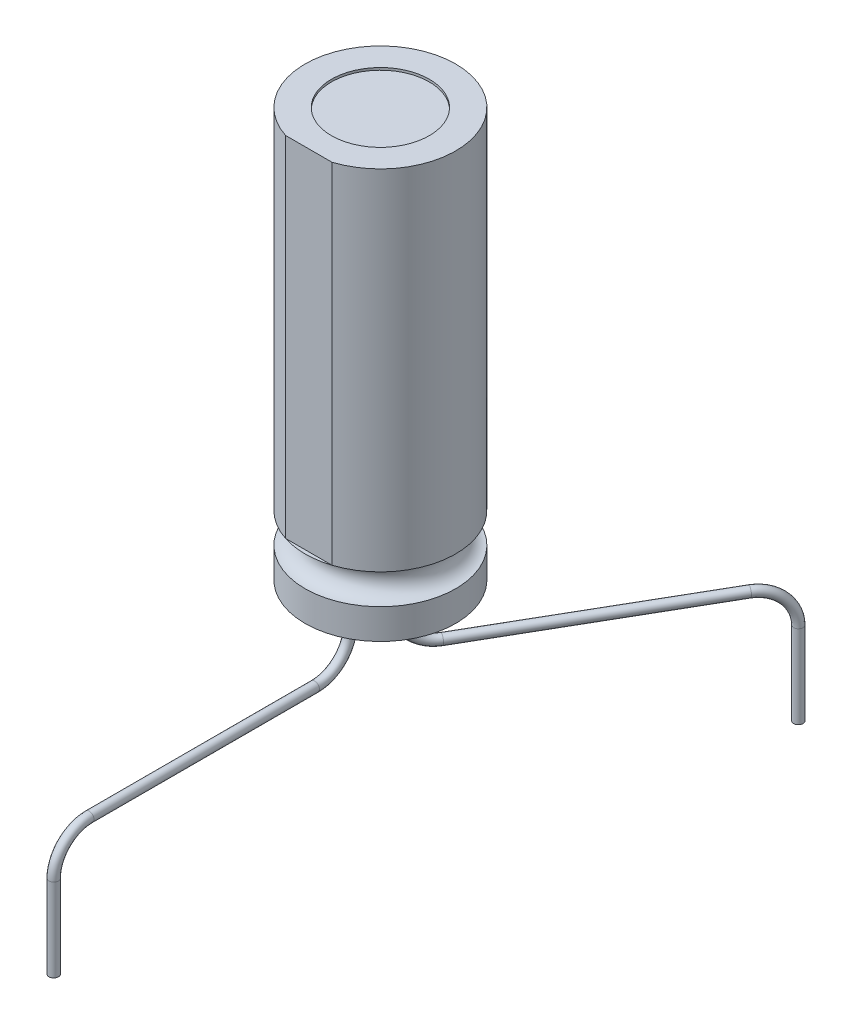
ISO-10303-21;
HEADER;
FILE_DESCRIPTION(('STEP AP214'),'2;1');
FILE_NAME('part.step','',(''),(''),'','','');
FILE_SCHEMA(('AUTOMOTIVE_DESIGN { 1 0 10303 214 1 1 1 1 }'));
ENDSEC;
DATA;
#1=APPLICATION_CONTEXT('core data for automotive mechanical design processes');
#2=APPLICATION_PROTOCOL_DEFINITION('international standard','automotive_design',2000,#1);
#3=PRODUCT_CONTEXT('',#1,'mechanical');
#4=PRODUCT('Part','Part','',(#3));
#5=PRODUCT_RELATED_PRODUCT_CATEGORY('part','',(#4));
#6=PRODUCT_DEFINITION_FORMATION('','',#4);
#7=PRODUCT_DEFINITION_CONTEXT('part definition',#1,'design');
#8=PRODUCT_DEFINITION('design','',#6,#7);
#9=PRODUCT_DEFINITION_SHAPE('','',#8);
#10=(LENGTH_UNIT() NAMED_UNIT(*) SI_UNIT(.MILLI.,.METRE.));
#11=(NAMED_UNIT(*) PLANE_ANGLE_UNIT() SI_UNIT($,.RADIAN.));
#12=(NAMED_UNIT(*) SI_UNIT($,.STERADIAN.) SOLID_ANGLE_UNIT());
#13=UNCERTAINTY_MEASURE_WITH_UNIT(LENGTH_MEASURE(1.E-05),#10,'distance_accuracy_value','');
#14=(GEOMETRIC_REPRESENTATION_CONTEXT(3) GLOBAL_UNCERTAINTY_ASSIGNED_CONTEXT((#13)) GLOBAL_UNIT_ASSIGNED_CONTEXT((#10,
#11,#12)) REPRESENTATION_CONTEXT('',''));
#15=CARTESIAN_POINT('',(0.,0.,0.));
#16=DIRECTION('',(0.,0.,1.));
#17=DIRECTION('',(1.,0.,0.));
#18=AXIS2_PLACEMENT_3D('',#15,#16,#17);
#19=CARTESIAN_POINT('',(6.35,5.01642366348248,0.));
#20=DIRECTION('',(0.,1.,0.));
#21=DIRECTION('',(0.,0.,1.));
#22=AXIS2_PLACEMENT_3D('',#19,#20,#21);
#23=PLANE('',#22);
#24=CARTESIAN_POINT('',(0.,5.01642366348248,2.54));
#25=DIRECTION('',(0.,-1.,0.));
#26=DIRECTION('',(0.,0.,-1.));
#27=AXIS2_PLACEMENT_3D('',#24,#25,#26);
#28=CIRCLE('',#27,0.4);
#29=CARTESIAN_POINT('',(0.,5.01642366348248,2.14));
#30=VERTEX_POINT('',#29);
#31=EDGE_CURVE('E34',#30,#30,#28,.T.);
#32=ORIENTED_EDGE('',*,*,#31,.F.);
#33=EDGE_LOOP('',(#32));
#34=FACE_BOUND('',#33,.T.);
#35=CARTESIAN_POINT('',(0.,5.01642366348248,0.));
#36=DIRECTION('',(0.,1.,0.));
#37=DIRECTION('',(0.,0.,1.));
#38=AXIS2_PLACEMENT_3D('',#35,#36,#37);
#39=CIRCLE('',#38,6.35);
#40=CARTESIAN_POINT('',(0.,5.01642366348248,6.35));
#41=VERTEX_POINT('',#40);
#42=EDGE_CURVE('E60',#41,#41,#39,.T.);
#43=ORIENTED_EDGE('',*,*,#42,.F.);
#44=EDGE_LOOP('',(#43));
#45=FACE_BOUND('',#44,.T.);
#46=CARTESIAN_POINT('',(0.394977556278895,5.01642366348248,-0.684121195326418));
#47=DIRECTION('',(0.,-1.,0.));
#48=DIRECTION('',(0.,0.,-1.));
#49=AXIS2_PLACEMENT_3D('',#46,#47,#48);
#50=CIRCLE('',#49,0.4);
#51=CARTESIAN_POINT('',(0.394977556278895,5.01642366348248,-1.08412119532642));
#52=VERTEX_POINT('',#51);
#53=EDGE_CURVE('E11',#52,#52,#50,.T.);
#54=ORIENTED_EDGE('',*,*,#53,.F.);
#55=EDGE_LOOP('',(#54));
#56=FACE_BOUND('',#55,.T.);
#57=ADVANCED_FACE('F26',(#34,#45,#56),#23,.F.);
#58=CARTESIAN_POINT('',(0.,48.4017094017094,0.));
#59=DIRECTION('',(0.,1.,0.));
#60=DIRECTION('',(0.,0.,1.));
#61=AXIS2_PLACEMENT_3D('',#58,#59,#60);
#62=CYLINDRICAL_SURFACE('',#61,6.35);
#63=DIRECTION('',(0.,1.,0.));
#64=VECTOR('',#63,1.);
#65=CARTESIAN_POINT('',(1.95982142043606,48.4017094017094,6.04));
#66=LINE('',#65,#64);
#67=CARTESIAN_POINT('',(1.95982142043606,10.0964236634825,6.04));
#68=VERTEX_POINT('',#67);
#69=CARTESIAN_POINT('',(1.95982142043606,39.5164236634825,6.04));
#70=VERTEX_POINT('',#69);
#71=EDGE_CURVE('E42',#68,#70,#66,.T.);
#72=ORIENTED_EDGE('',*,*,#71,.F.);
#73=CARTESIAN_POINT('',(0.,10.0964236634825,0.));
#74=DIRECTION('',(0.,1.,0.));
#75=DIRECTION('',(0.,0.,1.));
#76=AXIS2_PLACEMENT_3D('',#73,#74,#75);
#77=CIRCLE('',#76,6.35);
#78=CARTESIAN_POINT('',(-1.95982142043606,10.0964236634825,6.04));
#79=VERTEX_POINT('',#78);
#80=EDGE_CURVE('E66',#68,#79,#77,.T.);
#81=ORIENTED_EDGE('',*,*,#80,.T.);
#82=DIRECTION('',(0.,1.,0.));
#83=VECTOR('',#82,1.);
#84=CARTESIAN_POINT('',(-1.95982142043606,48.4017094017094,6.04));
#85=LINE('',#84,#83);
#86=CARTESIAN_POINT('',(-1.95982142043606,39.5164236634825,6.04));
#87=VERTEX_POINT('',#86);
#88=EDGE_CURVE('E56',#87,#79,#85,.F.);
#89=ORIENTED_EDGE('',*,*,#88,.F.);
#90=CARTESIAN_POINT('',(0.,39.5164236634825,0.));
#91=DIRECTION('',(0.,1.,0.));
#92=DIRECTION('',(0.,0.,1.));
#93=AXIS2_PLACEMENT_3D('',#90,#91,#92);
#94=CIRCLE('',#93,6.35);
#95=EDGE_CURVE('E64',#70,#87,#94,.T.);
#96=ORIENTED_EDGE('',*,*,#95,.F.);
#97=EDGE_LOOP('',(#72,#81,#89,#96));
#98=FACE_BOUND('',#97,.T.);
#99=ADVANCED_FACE('F63',(#98),#62,.T.);
#100=CARTESIAN_POINT('',(0.,39.5164236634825,0.));
#101=DIRECTION('',(0.,-1.,0.));
#102=DIRECTION('',(0.,0.,-1.));
#103=AXIS2_PLACEMENT_3D('',#100,#101,#102);
#104=PLANE('',#103);
#105=CARTESIAN_POINT('',(0.,39.5164236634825,0.));
#106=DIRECTION('',(0.,1.,0.));
#107=DIRECTION('',(0.,0.,1.));
#108=AXIS2_PLACEMENT_3D('',#105,#106,#107);
#109=CIRCLE('',#108,4.125);
#110=CARTESIAN_POINT('',(0.,39.5164236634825,4.125));
#111=VERTEX_POINT('',#110);
#112=EDGE_CURVE('E74',#111,#111,#109,.T.);
#113=ORIENTED_EDGE('',*,*,#112,.F.);
#114=EDGE_LOOP('',(#113));
#115=FACE_BOUND('',#114,.T.);
#116=DIRECTION('',(-1.,0.,0.));
#117=VECTOR('',#116,1.);
#118=CARTESIAN_POINT('',(0.,39.5164236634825,6.04));
#119=LINE('',#118,#117);
#120=EDGE_CURVE('E29',#70,#87,#119,.T.);
#121=ORIENTED_EDGE('',*,*,#120,.F.);
#122=ORIENTED_EDGE('',*,*,#95,.T.);
#123=EDGE_LOOP('',(#121,#122));
#124=FACE_BOUND('',#123,.T.);
#125=ADVANCED_FACE('F69',(#115,#124),#104,.F.);
#126=CARTESIAN_POINT('',(0.,48.4017094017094,0.));
#127=DIRECTION('',(0.,1.,0.));
#128=DIRECTION('',(0.,0.,1.));
#129=AXIS2_PLACEMENT_3D('',#126,#127,#128);
#130=CYLINDRICAL_SURFACE('',#129,6.35);
#131=CARTESIAN_POINT('',(0.,7.55642366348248,0.));
#132=DIRECTION('',(0.,1.,0.));
#133=DIRECTION('',(0.,0.,1.));
#134=AXIS2_PLACEMENT_3D('',#131,#132,#133);
#135=CIRCLE('',#134,6.35);
#136=CARTESIAN_POINT('',(0.,7.55642366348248,6.35));
#137=VERTEX_POINT('',#136);
#138=EDGE_CURVE('E78',#137,#137,#135,.T.);
#139=ORIENTED_EDGE('',*,*,#138,.F.);
#140=EDGE_LOOP('',(#139));
#141=FACE_BOUND('',#140,.T.);
#142=ORIENTED_EDGE('',*,*,#42,.T.);
#143=EDGE_LOOP('',(#142));
#144=FACE_BOUND('',#143,.T.);
#145=ADVANCED_FACE('F83',(#141,#144),#130,.T.);
#146=CARTESIAN_POINT('',(0.,8.82642366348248,0.));
#147=DIRECTION('',(0.,1.,0.));
#148=DIRECTION('',(0.,0.,1.));
#149=AXIS2_PLACEMENT_3D('',#146,#147,#148);
#150=TOROIDAL_SURFACE('',#149,6.35,1.27);
#151=ORIENTED_EDGE('',*,*,#80,.F.);
#152=EDGE_CURVE('E49',#79,#68,#77,.T.);
#153=ORIENTED_EDGE('',*,*,#152,.F.);
#154=EDGE_LOOP('',(#151,#153));
#155=FACE_BOUND('',#154,.T.);
#156=ORIENTED_EDGE('',*,*,#138,.T.);
#157=EDGE_LOOP('',(#156));
#158=FACE_BOUND('',#157,.T.);
#159=ADVANCED_FACE('F154',(#155,#158),#150,.F.);
#160=CARTESIAN_POINT('',(0.,39.3164236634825,0.));
#161=DIRECTION('',(0.,1.,0.));
#162=DIRECTION('',(0.,0.,1.));
#163=AXIS2_PLACEMENT_3D('',#160,#161,#162);
#164=CYLINDRICAL_SURFACE('',#163,4.125);
#165=CARTESIAN_POINT('',(0.,39.3164236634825,0.));
#166=DIRECTION('',(0.,1.,0.));
#167=DIRECTION('',(0.,0.,1.));
#168=AXIS2_PLACEMENT_3D('',#165,#166,#167);
#169=CIRCLE('',#168,4.125);
#170=CARTESIAN_POINT('',(0.,39.3164236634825,4.125));
#171=VERTEX_POINT('',#170);
#172=EDGE_CURVE('E70',#171,#171,#169,.T.);
#173=ORIENTED_EDGE('',*,*,#172,.F.);
#174=EDGE_LOOP('',(#173));
#175=FACE_BOUND('',#174,.T.);
#176=ORIENTED_EDGE('',*,*,#112,.T.);
#177=EDGE_LOOP('',(#176));
#178=FACE_BOUND('',#177,.T.);
#179=ADVANCED_FACE('F150',(#175,#178),#164,.F.);
#180=CARTESIAN_POINT('',(0.,39.3164236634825,0.));
#181=DIRECTION('',(0.,1.,0.));
#182=DIRECTION('',(0.,0.,1.));
#183=AXIS2_PLACEMENT_3D('',#180,#181,#182);
#184=PLANE('',#183);
#185=ORIENTED_EDGE('',*,*,#172,.T.);
#186=EDGE_LOOP('',(#185));
#187=FACE_BOUND('',#186,.T.);
#188=ADVANCED_FACE('F147',(#187),#184,.T.);
#189=CARTESIAN_POINT('',(-2.5,10.0964236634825,6.04));
#190=DIRECTION('',(0.,-1.,0.));
#191=DIRECTION('',(0.,0.,-1.));
#192=AXIS2_PLACEMENT_3D('',#189,#190,#191);
#193=PLANE('',#192);
#194=DIRECTION('',(1.,0.,0.));
#195=VECTOR('',#194,1.);
#196=CARTESIAN_POINT('',(-2.5,10.0964236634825,6.04));
#197=LINE('',#196,#195);
#198=EDGE_CURVE('E67',#79,#68,#197,.T.);
#199=ORIENTED_EDGE('',*,*,#198,.F.);
#200=ORIENTED_EDGE('',*,*,#152,.T.);
#201=EDGE_LOOP('',(#199,#200));
#202=FACE_BOUND('',#201,.T.);
#203=ADVANCED_FACE('F144',(#202),#193,.F.);
#204=CARTESIAN_POINT('',(-2.5,10.0964236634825,6.04));
#205=DIRECTION('',(0.,0.,1.));
#206=DIRECTION('',(1.,0.,0.));
#207=AXIS2_PLACEMENT_3D('',#204,#205,#206);
#208=PLANE('',#207);
#209=ORIENTED_EDGE('',*,*,#71,.T.);
#210=ORIENTED_EDGE('',*,*,#120,.T.);
#211=ORIENTED_EDGE('',*,*,#88,.T.);
#212=ORIENTED_EDGE('',*,*,#198,.T.);
#213=EDGE_LOOP('',(#209,#210,#211,#212));
#214=FACE_BOUND('',#213,.T.);
#215=ADVANCED_FACE('F55',(#214),#208,.T.);
#216=CARTESIAN_POINT('',(0.,-2.98357633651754,27.54));
#217=DIRECTION('',(0.,-1.,0.));
#218=DIRECTION('',(0.,0.,-1.));
#219=AXIS2_PLACEMENT_3D('',#216,#217,#218);
#220=CYLINDRICAL_SURFACE('',#219,0.4);
#221=CARTESIAN_POINT('',(0.,-2.98357633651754,27.54));
#222=DIRECTION('',(0.,-1.,0.));
#223=DIRECTION('',(0.,0.,-1.));
#224=AXIS2_PLACEMENT_3D('',#221,#222,#223);
#225=CIRCLE('',#224,0.4);
#226=CARTESIAN_POINT('',(0.,-2.98357633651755,27.94));
#227=VERTEX_POINT('',#226);
#228=EDGE_CURVE('E258',#227,#227,#225,.T.);
#229=ORIENTED_EDGE('',*,*,#228,.T.);
#230=EDGE_LOOP('',(#229));
#231=FACE_BOUND('',#230,.T.);
#232=CARTESIAN_POINT('',(0.,-9.98357633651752,27.54));
#233=DIRECTION('',(0.,-1.,0.));
#234=DIRECTION('',(0.,0.,-1.));
#235=AXIS2_PLACEMENT_3D('',#232,#233,#234);
#236=CIRCLE('',#235,0.4);
#237=CARTESIAN_POINT('',(0.,-9.98357633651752,27.14));
#238=VERTEX_POINT('',#237);
#239=EDGE_CURVE('E255',#238,#238,#236,.T.);
#240=ORIENTED_EDGE('',*,*,#239,.F.);
#241=EDGE_LOOP('',(#240));
#242=FACE_BOUND('',#241,.T.);
#243=ADVANCED_FACE('F137',(#231,#242),#220,.T.);
#244=CARTESIAN_POINT('',(0.,-2.98357633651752,24.54));
#245=DIRECTION('',(1.,0.,0.));
#246=DIRECTION('',(0.,0.,-1.));
#247=AXIS2_PLACEMENT_3D('',#244,#245,#246);
#248=TOROIDAL_SURFACE('',#247,3.,0.4);
#249=CARTESIAN_POINT('',(0.,0.0164236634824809,24.54));
#250=DIRECTION('',(0.,0.,1.));
#251=DIRECTION('',(0.,-1.,0.));
#252=AXIS2_PLACEMENT_3D('',#249,#250,#251);
#253=CIRCLE('',#252,0.4);
#254=CARTESIAN_POINT('',(0.,0.416423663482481,24.54));
#255=VERTEX_POINT('',#254);
#256=EDGE_CURVE('E261',#255,#255,#253,.T.);
#257=CARTESIAN_POINT('',(0.,-2.98357633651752,24.54));
#258=DIRECTION('',(1.,0.,0.));
#259=DIRECTION('',(0.,0.,-1.));
#260=AXIS2_PLACEMENT_3D('',#257,#258,#259);
#261=CIRCLE('',#260,3.4);
#262=EDGE_CURVE('',#255,#227,#261,.T.);
#263=ORIENTED_EDGE('',*,*,#256,.T.);
#264=ORIENTED_EDGE('',*,*,#228,.F.);
#265=ORIENTED_EDGE('',*,*,#262,.T.);
#266=ORIENTED_EDGE('',*,*,#262,.F.);
#267=EDGE_LOOP('',(#263,#265,#264,#266));
#268=FACE_BOUND('',#267,.T.);
#269=ADVANCED_FACE('F133',(#268),#248,.T.);
#270=CARTESIAN_POINT('',(0.,0.0164236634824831,5.54000000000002));
#271=DIRECTION('',(0.,0.,1.));
#272=DIRECTION('',(0.,-1.,0.));
#273=AXIS2_PLACEMENT_3D('',#270,#271,#272);
#274=CYLINDRICAL_SURFACE('',#273,0.4);
#275=CARTESIAN_POINT('',(0.,0.0164236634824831,5.54000000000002));
#276=DIRECTION('',(0.,0.,1.));
#277=DIRECTION('',(0.,-1.,0.));
#278=AXIS2_PLACEMENT_3D('',#275,#276,#277);
#279=CIRCLE('',#278,0.4);
#280=CARTESIAN_POINT('',(0.,-0.383576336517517,5.54000000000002));
#281=VERTEX_POINT('',#280);
#282=EDGE_CURVE('E264',#281,#281,#279,.T.);
#283=ORIENTED_EDGE('',*,*,#282,.T.);
#284=EDGE_LOOP('',(#283));
#285=FACE_BOUND('',#284,.T.);
#286=ORIENTED_EDGE('',*,*,#256,.F.);
#287=EDGE_LOOP('',(#286));
#288=FACE_BOUND('',#287,.T.);
#289=ADVANCED_FACE('F129',(#285,#288),#274,.T.);
#290=CARTESIAN_POINT('',(0.,3.01642366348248,5.54));
#291=DIRECTION('',(-1.,0.,0.));
#292=DIRECTION('',(0.,0.,1.));
#293=AXIS2_PLACEMENT_3D('',#290,#291,#292);
#294=TOROIDAL_SURFACE('',#293,3.,0.4);
#295=CARTESIAN_POINT('',(0.,3.0164236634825,2.54));
#296=DIRECTION('',(0.,-1.,0.));
#297=DIRECTION('',(0.,0.,-1.));
#298=AXIS2_PLACEMENT_3D('',#295,#296,#297);
#299=CIRCLE('',#298,0.4);
#300=CARTESIAN_POINT('',(0.,3.01642366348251,2.14));
#301=VERTEX_POINT('',#300);
#302=EDGE_CURVE('E267',#301,#301,#299,.T.);
#303=CARTESIAN_POINT('',(0.,3.01642366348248,5.54));
#304=DIRECTION('',(-1.,0.,0.));
#305=DIRECTION('',(0.,0.,1.));
#306=AXIS2_PLACEMENT_3D('',#303,#304,#305);
#307=CIRCLE('',#306,3.4);
#308=EDGE_CURVE('',#301,#281,#307,.T.);
#309=ORIENTED_EDGE('',*,*,#302,.T.);
#310=ORIENTED_EDGE('',*,*,#282,.F.);
#311=ORIENTED_EDGE('',*,*,#308,.T.);
#312=ORIENTED_EDGE('',*,*,#308,.F.);
#313=EDGE_LOOP('',(#309,#311,#310,#312));
#314=FACE_BOUND('',#313,.T.);
#315=ADVANCED_FACE('F125',(#314),#294,.T.);
#316=CARTESIAN_POINT('',(0.,3.0164236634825,2.54));
#317=DIRECTION('',(0.,1.,0.));
#318=DIRECTION('',(0.,0.,1.));
#319=AXIS2_PLACEMENT_3D('',#316,#317,#318);
#320=CYLINDRICAL_SURFACE('',#319,0.4);
#321=ORIENTED_EDGE('',*,*,#302,.F.);
#322=EDGE_LOOP('',(#321));
#323=FACE_BOUND('',#322,.T.);
#324=ORIENTED_EDGE('',*,*,#31,.T.);
#325=EDGE_LOOP('',(#324));
#326=FACE_BOUND('',#325,.T.);
#327=ADVANCED_FACE('F121',(#323,#326),#320,.T.);
#328=CARTESIAN_POINT('',(0.,-9.98357633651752,27.54));
#329=DIRECTION('',(0.,-1.,0.));
#330=DIRECTION('',(0.,0.,-1.));
#331=AXIS2_PLACEMENT_3D('',#328,#329,#330);
#332=PLANE('',#331);
#333=ORIENTED_EDGE('',*,*,#239,.T.);
#334=EDGE_LOOP('',(#333));
#335=FACE_BOUND('',#334,.T.);
#336=ADVANCED_FACE('F117',(#335),#332,.T.);
#337=CARTESIAN_POINT('',(12.8949775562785,-2.98357633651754,-22.3347562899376));
#338=DIRECTION('',(0.,-1.,0.));
#339=DIRECTION('',(1.,0.,0.));
#340=AXIS2_PLACEMENT_3D('',#337,#338,#339);
#341=CYLINDRICAL_SURFACE('',#340,0.4);
#342=CARTESIAN_POINT('',(12.8949775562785,-2.98357633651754,-22.3347562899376));
#343=DIRECTION('',(0.,-1.,0.));
#344=DIRECTION('',(0.,0.,-1.));
#345=AXIS2_PLACEMENT_3D('',#342,#343,#344);
#346=CIRCLE('',#345,0.4);
#347=CARTESIAN_POINT('',(13.0949775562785,-2.98357633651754,-22.6811664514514));
#348=VERTEX_POINT('',#347);
#349=EDGE_CURVE('E275',#348,#348,#346,.T.);
#350=ORIENTED_EDGE('',*,*,#349,.T.);
#351=EDGE_LOOP('',(#350));
#352=FACE_BOUND('',#351,.T.);
#353=CARTESIAN_POINT('',(12.8949775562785,-9.98357633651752,-22.3347562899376));
#354=DIRECTION('',(0.,-1.,0.));
#355=DIRECTION('',(0.,0.,-1.));
#356=AXIS2_PLACEMENT_3D('',#353,#354,#355);
#357=CIRCLE('',#356,0.4);
#358=CARTESIAN_POINT('',(12.8949775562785,-9.98357633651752,-22.7347562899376));
#359=VERTEX_POINT('',#358);
#360=EDGE_CURVE('E270',#359,#359,#357,.T.);
#361=ORIENTED_EDGE('',*,*,#360,.F.);
#362=EDGE_LOOP('',(#361));
#363=FACE_BOUND('',#362,.T.);
#364=ADVANCED_FACE('F113',(#352,#363),#341,.T.);
#365=CARTESIAN_POINT('',(11.3949775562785,-2.98357633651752,-19.7366800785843));
#366=DIRECTION('',(-0.866025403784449,0.,-0.499999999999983));
#367=DIRECTION('',(-0.499999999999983,0.,0.866025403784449));
#368=AXIS2_PLACEMENT_3D('',#365,#366,#367);
#369=TOROIDAL_SURFACE('',#368,3.,0.4);
#370=CARTESIAN_POINT('',(11.3949775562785,0.0164236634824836,-19.7366800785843));
#371=DIRECTION('',(0.499999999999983,0.,-0.866025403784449));
#372=DIRECTION('',(-0.433012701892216,0.866025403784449,-0.249999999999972));
#373=AXIS2_PLACEMENT_3D('',#370,#371,#372);
#374=CIRCLE('',#373,0.4);
#375=CARTESIAN_POINT('',(11.3949775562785,0.416423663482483,-19.7366800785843));
#376=VERTEX_POINT('',#375);
#377=EDGE_CURVE('E278',#376,#376,#374,.T.);
#378=CARTESIAN_POINT('',(11.3949775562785,-2.98357633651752,-19.7366800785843));
#379=DIRECTION('',(-0.866025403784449,0.,-0.499999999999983));
#380=DIRECTION('',(-0.499999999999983,0.,0.866025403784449));
#381=AXIS2_PLACEMENT_3D('',#378,#379,#380);
#382=CIRCLE('',#381,3.4);
#383=EDGE_CURVE('',#376,#348,#382,.T.);
#384=ORIENTED_EDGE('',*,*,#377,.T.);
#385=ORIENTED_EDGE('',*,*,#349,.F.);
#386=ORIENTED_EDGE('',*,*,#383,.T.);
#387=ORIENTED_EDGE('',*,*,#383,.F.);
#388=EDGE_LOOP('',(#384,#386,#385,#387));
#389=FACE_BOUND('',#388,.T.);
#390=ADVANCED_FACE('F109',(#389),#369,.T.);
#391=CARTESIAN_POINT('',(1.89497755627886,0.0164236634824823,-3.28219740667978));
#392=DIRECTION('',(0.499999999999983,0.,-0.866025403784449));
#393=DIRECTION('',(-0.866025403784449,0.,-0.499999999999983));
#394=AXIS2_PLACEMENT_3D('',#391,#392,#393);
#395=CYLINDRICAL_SURFACE('',#394,0.4);
#396=CARTESIAN_POINT('',(1.89497755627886,0.0164236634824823,-3.28219740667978));
#397=DIRECTION('',(0.499999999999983,0.,-0.866025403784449));
#398=DIRECTION('',(-0.433012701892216,0.866025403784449,-0.249999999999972));
#399=AXIS2_PLACEMENT_3D('',#396,#397,#398);
#400=CIRCLE('',#399,0.4);
#401=CARTESIAN_POINT('',(1.89497755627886,-0.383576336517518,-3.28219740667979));
#402=VERTEX_POINT('',#401);
#403=EDGE_CURVE('E281',#402,#402,#400,.T.);
#404=ORIENTED_EDGE('',*,*,#403,.T.);
#405=EDGE_LOOP('',(#404));
#406=FACE_BOUND('',#405,.T.);
#407=ORIENTED_EDGE('',*,*,#377,.F.);
#408=EDGE_LOOP('',(#407));
#409=FACE_BOUND('',#408,.T.);
#410=ADVANCED_FACE('F102',(#406,#409),#395,.T.);
#411=CARTESIAN_POINT('',(1.89497755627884,3.01642366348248,-3.28219740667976));
#412=DIRECTION('',(0.866025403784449,0.,0.499999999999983));
#413=DIRECTION('',(0.499999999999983,0.,-0.866025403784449));
#414=AXIS2_PLACEMENT_3D('',#411,#412,#413);
#415=TOROIDAL_SURFACE('',#414,3.,0.4);
#416=CARTESIAN_POINT('',(0.394977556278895,3.0164236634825,-0.684121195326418));
#417=DIRECTION('',(0.,-1.,0.));
#418=DIRECTION('',(0.,0.,-1.));
#419=AXIS2_PLACEMENT_3D('',#416,#417,#418);
#420=CIRCLE('',#419,0.4);
#421=CARTESIAN_POINT('',(0.194977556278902,3.01642366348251,-0.337711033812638));
#422=VERTEX_POINT('',#421);
#423=EDGE_CURVE('E284',#422,#422,#420,.T.);
#424=CARTESIAN_POINT('',(1.89497755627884,3.01642366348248,-3.28219740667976));
#425=DIRECTION('',(0.866025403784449,0.,0.499999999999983));
#426=DIRECTION('',(0.499999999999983,0.,-0.866025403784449));
#427=AXIS2_PLACEMENT_3D('',#424,#425,#426);
#428=CIRCLE('',#427,3.4);
#429=EDGE_CURVE('',#422,#402,#428,.T.);
#430=ORIENTED_EDGE('',*,*,#423,.T.);
#431=ORIENTED_EDGE('',*,*,#403,.F.);
#432=ORIENTED_EDGE('',*,*,#429,.T.);
#433=ORIENTED_EDGE('',*,*,#429,.F.);
#434=EDGE_LOOP('',(#430,#432,#431,#433));
#435=FACE_BOUND('',#434,.T.);
#436=ADVANCED_FACE('F93',(#435),#415,.T.);
#437=CARTESIAN_POINT('',(0.394977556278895,3.0164236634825,-0.684121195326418));
#438=DIRECTION('',(0.,1.,0.));
#439=DIRECTION('',(0.,0.,1.));
#440=AXIS2_PLACEMENT_3D('',#437,#438,#439);
#441=CYLINDRICAL_SURFACE('',#440,0.4);
#442=ORIENTED_EDGE('',*,*,#423,.F.);
#443=EDGE_LOOP('',(#442));
#444=FACE_BOUND('',#443,.T.);
#445=ORIENTED_EDGE('',*,*,#53,.T.);
#446=EDGE_LOOP('',(#445));
#447=FACE_BOUND('',#446,.T.);
#448=ADVANCED_FACE('F90',(#444,#447),#441,.T.);
#449=CARTESIAN_POINT('',(12.8949775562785,-9.98357633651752,-22.3347562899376));
#450=DIRECTION('',(0.,-1.,0.));
#451=DIRECTION('',(0.,0.,-1.));
#452=AXIS2_PLACEMENT_3D('',#449,#450,#451);
#453=PLANE('',#452);
#454=ORIENTED_EDGE('',*,*,#360,.T.);
#455=EDGE_LOOP('',(#454));
#456=FACE_BOUND('',#455,.T.);
#457=ADVANCED_FACE('F92',(#456),#453,.T.);
#458=CLOSED_SHELL('',(#57,#99,#125,#145,#159,#179,#188,#203,#215,#243,#269,#289,#315,#327,#336,
#364,#390,#410,#436,#448,#457));
#459=MANIFOLD_SOLID_BREP('B2',#458);
#460=ADVANCED_BREP_SHAPE_REPRESENTATION('',(#18,#459),#14);
#461=SHAPE_DEFINITION_REPRESENTATION(#9,#460);
ENDSEC;
END-ISO-10303-21;
